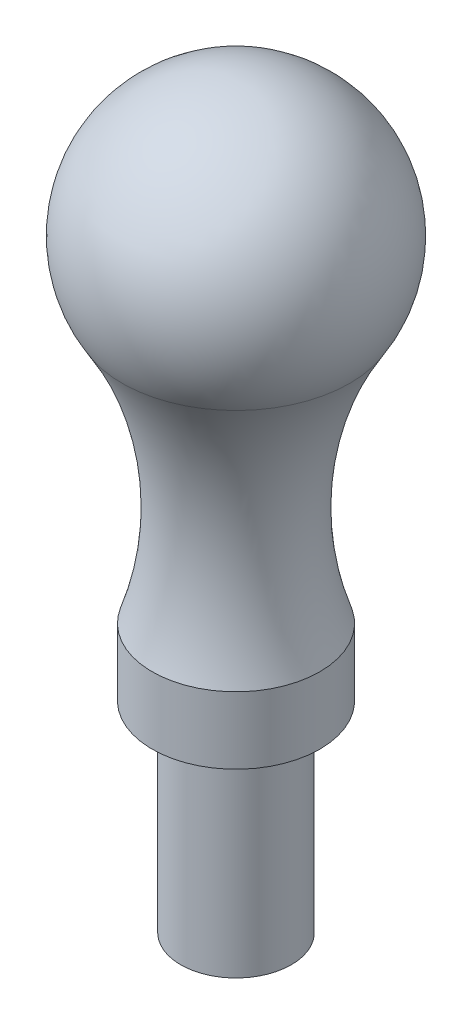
from build123d import *


with BuildPart() as part:
    # Sketch 1 → Revolve 1 (revolve)
    with BuildSketch(Plane.XY, mode=Mode.PRIVATE) as revolve_1_sk:
        with BuildLine():
            Line((-7, 49.008579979), (-8.65, 49.008579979))
            Line((-8.65, 49.008579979), (-8.65, 55))
            Line((-8.65, 55), (-9.5, 55))
            Line((-9.5, 55), (-9.5, 57))
            ThreePointArc((-9.5, 57), (-9.059237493, 61.049407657), (-10.397089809, 64.896760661))
            ThreePointArc((-10.397089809, 64.896760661), (-10.496232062, 68.951866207), (-7, 71.008579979))
            Line((-7, 71.008579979), (-7, 49.008579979))
        make_face()
    revolve(revolve_1_sk.sketch.rotate(Axis((-7, 49.008579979, 0), (0, 1, 0)), 180), axis=Axis((-7, 49.008579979, 0), (0, 1, 0)))


solid = part.part
